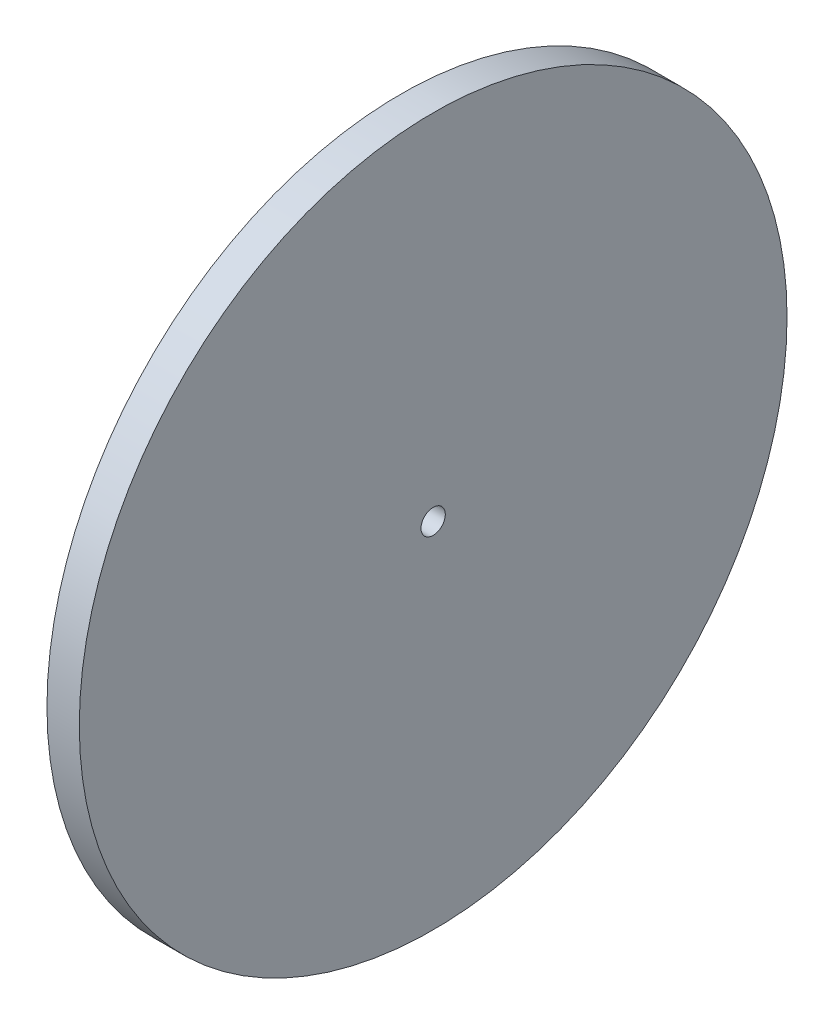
from build123d import *

# Parameters (mm, degrees)
ESQUISSE1_R        = 87.535
ESQUISSE1_R_2      = 3
BOSS_EXTRU_1_DEPTH = 8


with BuildPart() as part:
    # Esquisse1 → Boss.-Extru.1 (new body)
    with BuildSketch(Plane(origin=(0, 0, 0), x_dir=(0, 0, -1), z_dir=(1, 0, 0))):
        Circle(ESQUISSE1_R)
        Circle(ESQUISSE1_R_2, mode=Mode.SUBTRACT)
    extrude(amount=BOSS_EXTRU_1_DEPTH)


solid = part.part
